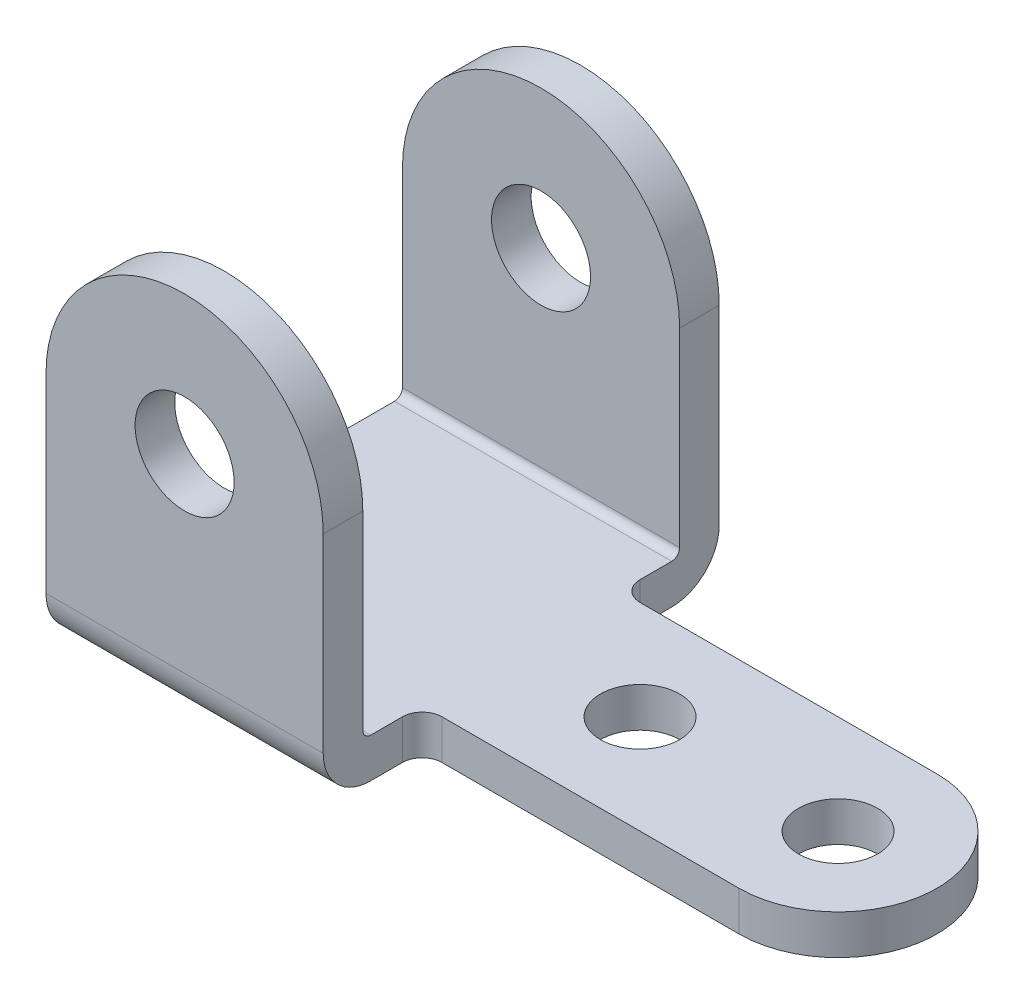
ISO-10303-21;
HEADER;
FILE_DESCRIPTION(('STEP AP214'),'2;1');
FILE_NAME('part.step','',(''),(''),'','','');
FILE_SCHEMA(('AUTOMOTIVE_DESIGN { 1 0 10303 214 1 1 1 1 }'));
ENDSEC;
DATA;
#1=APPLICATION_CONTEXT('core data for automotive mechanical design processes');
#2=APPLICATION_PROTOCOL_DEFINITION('international standard','automotive_design',2000,#1);
#3=PRODUCT_CONTEXT('',#1,'mechanical');
#4=PRODUCT('Part','Part','',(#3));
#5=PRODUCT_RELATED_PRODUCT_CATEGORY('part','',(#4));
#6=PRODUCT_DEFINITION_FORMATION('','',#4);
#7=PRODUCT_DEFINITION_CONTEXT('part definition',#1,'design');
#8=PRODUCT_DEFINITION('design','',#6,#7);
#9=PRODUCT_DEFINITION_SHAPE('','',#8);
#10=(LENGTH_UNIT() NAMED_UNIT(*) SI_UNIT(.MILLI.,.METRE.));
#11=(NAMED_UNIT(*) PLANE_ANGLE_UNIT() SI_UNIT($,.RADIAN.));
#12=(NAMED_UNIT(*) SI_UNIT($,.STERADIAN.) SOLID_ANGLE_UNIT());
#13=UNCERTAINTY_MEASURE_WITH_UNIT(LENGTH_MEASURE(1.E-05),#10,'distance_accuracy_value','');
#14=(GEOMETRIC_REPRESENTATION_CONTEXT(3) GLOBAL_UNCERTAINTY_ASSIGNED_CONTEXT((#13)) GLOBAL_UNIT_ASSIGNED_CONTEXT((#10,
#11,#12)) REPRESENTATION_CONTEXT('',''));
#15=CARTESIAN_POINT('',(0.,0.,0.));
#16=DIRECTION('',(0.,0.,1.));
#17=DIRECTION('',(1.,0.,0.));
#18=AXIS2_PLACEMENT_3D('',#15,#16,#17);
#19=CARTESIAN_POINT('',(35.,-60.,100.));
#20=DIRECTION('',(-1.,0.,0.));
#21=DIRECTION('',(0.,-1.,0.));
#22=AXIS2_PLACEMENT_3D('',#19,#20,#21);
#23=PLANE('',#22);
#24=DIRECTION('',(0.,0.,-1.));
#25=VECTOR('',#24,1.);
#26=CARTESIAN_POINT('',(35.,-60.,100.));
#27=LINE('',#26,#25);
#28=CARTESIAN_POINT('',(35.,-60.,88.));
#29=VERTEX_POINT('',#28);
#30=CARTESIAN_POINT('',(35.,-60.,80.));
#31=VERTEX_POINT('',#30);
#32=EDGE_CURVE('E264',#29,#31,#27,.T.);
#33=ORIENTED_EDGE('',*,*,#32,.T.);
#34=DIRECTION('',(0.,-1.,0.));
#35=VECTOR('',#34,1.);
#36=CARTESIAN_POINT('',(35.,-50.,80.));
#37=LINE('',#36,#35);
#38=CARTESIAN_POINT('',(35.,-50.,80.));
#39=VERTEX_POINT('',#38);
#40=EDGE_CURVE('E58',#31,#39,#37,.F.);
#41=ORIENTED_EDGE('',*,*,#40,.T.);
#42=DIRECTION('',(0.,0.,-1.));
#43=VECTOR('',#42,1.);
#44=CARTESIAN_POINT('',(35.,-50.,100.));
#45=LINE('',#44,#43);
#46=CARTESIAN_POINT('',(35.,-50.,88.));
#47=VERTEX_POINT('',#46);
#48=EDGE_CURVE('E217',#47,#39,#45,.T.);
#49=ORIENTED_EDGE('',*,*,#48,.F.);
#50=CARTESIAN_POINT('',(35.,-48.,88.));
#51=DIRECTION('',(-1.,0.,0.));
#52=DIRECTION('',(0.,-1.,0.));
#53=AXIS2_PLACEMENT_3D('',#50,#51,#52);
#54=CIRCLE('',#53,2.);
#55=CARTESIAN_POINT('',(35.,-48.,90.));
#56=VERTEX_POINT('',#55);
#57=EDGE_CURVE('E208',#56,#47,#54,.F.);
#58=ORIENTED_EDGE('',*,*,#57,.F.);
#59=DIRECTION('',(0.,1.,0.));
#60=VECTOR('',#59,1.);
#61=CARTESIAN_POINT('',(35.,-60.,90.));
#62=LINE('',#61,#60);
#63=CARTESIAN_POINT('',(35.,0.,90.));
#64=VERTEX_POINT('',#63);
#65=EDGE_CURVE('E238',#56,#64,#62,.T.);
#66=ORIENTED_EDGE('',*,*,#65,.T.);
#67=DIRECTION('',(0.,0.,-1.));
#68=VECTOR('',#67,1.);
#69=CARTESIAN_POINT('',(35.,0.,100.));
#70=LINE('',#69,#68);
#71=CARTESIAN_POINT('',(35.,0.,100.));
#72=VERTEX_POINT('',#71);
#73=EDGE_CURVE('E261',#72,#64,#70,.T.);
#74=ORIENTED_EDGE('',*,*,#73,.F.);
#75=DIRECTION('',(0.,1.,0.));
#76=VECTOR('',#75,1.);
#77=CARTESIAN_POINT('',(35.,-60.,100.));
#78=LINE('',#77,#76);
#79=CARTESIAN_POINT('',(35.,-48.,100.));
#80=VERTEX_POINT('',#79);
#81=EDGE_CURVE('E252',#80,#72,#78,.T.);
#82=ORIENTED_EDGE('',*,*,#81,.F.);
#83=CARTESIAN_POINT('',(35.,-48.,88.));
#84=DIRECTION('',(-1.,0.,0.));
#85=DIRECTION('',(0.,-1.,0.));
#86=AXIS2_PLACEMENT_3D('',#83,#84,#85);
#87=CIRCLE('',#86,12.);
#88=EDGE_CURVE('E278',#80,#29,#87,.F.);
#89=ORIENTED_EDGE('',*,*,#88,.T.);
#90=EDGE_LOOP('',(#33,#41,#49,#58,#66,#74,#82,#89));
#91=FACE_BOUND('',#90,.T.);
#92=ADVANCED_FACE('F39',(#91),#23,.F.);
#93=CARTESIAN_POINT('',(0.,0.,100.));
#94=DIRECTION('',(0.,0.,-1.));
#95=DIRECTION('',(-1.,0.,0.));
#96=AXIS2_PLACEMENT_3D('',#93,#94,#95);
#97=CYLINDRICAL_SURFACE('',#96,35.);
#98=CARTESIAN_POINT('',(0.,0.,9.99999999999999));
#99=DIRECTION('',(0.,0.,1.));
#100=DIRECTION('',(1.,0.,0.));
#101=AXIS2_PLACEMENT_3D('',#98,#99,#100);
#102=CIRCLE('',#101,35.);
#103=CARTESIAN_POINT('',(35.,0.,9.99999999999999));
#104=VERTEX_POINT('',#103);
#105=CARTESIAN_POINT('',(-35.,0.,9.99999999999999));
#106=VERTEX_POINT('',#105);
#107=EDGE_CURVE('E205',#104,#106,#102,.T.);
#108=ORIENTED_EDGE('',*,*,#107,.F.);
#109=CARTESIAN_POINT('',(35.,0.,0.));
#110=VERTEX_POINT('',#109);
#111=EDGE_CURVE('E254',#104,#110,#70,.T.);
#112=ORIENTED_EDGE('',*,*,#111,.T.);
#113=CARTESIAN_POINT('',(0.,0.,0.));
#114=DIRECTION('',(0.,0.,1.));
#115=DIRECTION('',(1.,0.,0.));
#116=AXIS2_PLACEMENT_3D('',#113,#114,#115);
#117=CIRCLE('',#116,35.);
#118=CARTESIAN_POINT('',(-35.,0.,0.));
#119=VERTEX_POINT('',#118);
#120=EDGE_CURVE('E220',#110,#119,#117,.T.);
#121=ORIENTED_EDGE('',*,*,#120,.T.);
#122=DIRECTION('',(0.,0.,-1.));
#123=VECTOR('',#122,1.);
#124=CARTESIAN_POINT('',(-35.,0.,100.));
#125=LINE('',#124,#123);
#126=EDGE_CURVE('E267',#106,#119,#125,.T.);
#127=ORIENTED_EDGE('',*,*,#126,.F.);
#128=EDGE_LOOP('',(#108,#112,#121,#127));
#129=FACE_BOUND('',#128,.T.);
#130=ADVANCED_FACE('F376',(#129),#97,.T.);
#131=ORIENTED_EDGE('',*,*,#73,.T.);
#132=CARTESIAN_POINT('',(0.,0.,90.));
#133=DIRECTION('',(0.,0.,1.));
#134=DIRECTION('',(1.,0.,0.));
#135=AXIS2_PLACEMENT_3D('',#132,#133,#134);
#136=CIRCLE('',#135,35.);
#137=CARTESIAN_POINT('',(-35.,0.,90.));
#138=VERTEX_POINT('',#137);
#139=EDGE_CURVE('E228',#64,#138,#136,.T.);
#140=ORIENTED_EDGE('',*,*,#139,.T.);
#141=CARTESIAN_POINT('',(-35.,0.,100.));
#142=VERTEX_POINT('',#141);
#143=EDGE_CURVE('E272',#142,#138,#125,.T.);
#144=ORIENTED_EDGE('',*,*,#143,.F.);
#145=CARTESIAN_POINT('',(0.,0.,100.));
#146=DIRECTION('',(0.,0.,1.));
#147=DIRECTION('',(1.,0.,0.));
#148=AXIS2_PLACEMENT_3D('',#145,#146,#147);
#149=CIRCLE('',#148,35.);
#150=EDGE_CURVE('E242',#72,#142,#149,.T.);
#151=ORIENTED_EDGE('',*,*,#150,.F.);
#152=EDGE_LOOP('',(#131,#140,#144,#151));
#153=FACE_BOUND('',#152,.T.);
#154=ADVANCED_FACE('F347',(#153),#97,.T.);
#155=CARTESIAN_POINT('',(-35.,0.,100.));
#156=DIRECTION('',(1.,0.,0.));
#157=DIRECTION('',(0.,1.,0.));
#158=AXIS2_PLACEMENT_3D('',#155,#156,#157);
#159=PLANE('',#158);
#160=ORIENTED_EDGE('',*,*,#143,.T.);
#161=DIRECTION('',(0.,-1.,0.));
#162=VECTOR('',#161,1.);
#163=CARTESIAN_POINT('',(-35.,0.,90.));
#164=LINE('',#163,#162);
#165=CARTESIAN_POINT('',(-35.,-48.,90.));
#166=VERTEX_POINT('',#165);
#167=EDGE_CURVE('E232',#138,#166,#164,.T.);
#168=ORIENTED_EDGE('',*,*,#167,.T.);
#169=CARTESIAN_POINT('',(-35.,-48.,88.));
#170=DIRECTION('',(1.,0.,0.));
#171=DIRECTION('',(0.,1.,0.));
#172=AXIS2_PLACEMENT_3D('',#169,#170,#171);
#173=CIRCLE('',#172,2.);
#174=CARTESIAN_POINT('',(-35.,-50.,88.));
#175=VERTEX_POINT('',#174);
#176=EDGE_CURVE('E216',#175,#166,#173,.F.);
#177=ORIENTED_EDGE('',*,*,#176,.F.);
#178=DIRECTION('',(0.,0.,-1.));
#179=VECTOR('',#178,1.);
#180=CARTESIAN_POINT('',(-35.,-50.,100.));
#181=LINE('',#180,#179);
#182=CARTESIAN_POINT('',(-35.,-50.,12.));
#183=VERTEX_POINT('',#182);
#184=EDGE_CURVE('E213',#175,#183,#181,.T.);
#185=ORIENTED_EDGE('',*,*,#184,.T.);
#186=CARTESIAN_POINT('',(-35.,-48.,12.));
#187=DIRECTION('',(1.,0.,0.));
#188=DIRECTION('',(0.,1.,0.));
#189=AXIS2_PLACEMENT_3D('',#186,#187,#188);
#190=CIRCLE('',#189,2.);
#191=CARTESIAN_POINT('',(-35.,-48.,10.));
#192=VERTEX_POINT('',#191);
#193=EDGE_CURVE('E207',#192,#183,#190,.F.);
#194=ORIENTED_EDGE('',*,*,#193,.F.);
#195=DIRECTION('',(0.,-1.,0.));
#196=VECTOR('',#195,1.);
#197=CARTESIAN_POINT('',(-35.,0.,9.99999999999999));
#198=LINE('',#197,#196);
#199=EDGE_CURVE('E227',#106,#192,#198,.T.);
#200=ORIENTED_EDGE('',*,*,#199,.F.);
#201=ORIENTED_EDGE('',*,*,#126,.T.);
#202=DIRECTION('',(0.,-1.,0.));
#203=VECTOR('',#202,1.);
#204=CARTESIAN_POINT('',(-35.,0.,0.));
#205=LINE('',#204,#203);
#206=CARTESIAN_POINT('',(-35.,-48.,0.));
#207=VERTEX_POINT('',#206);
#208=EDGE_CURVE('E256',#119,#207,#205,.T.);
#209=ORIENTED_EDGE('',*,*,#208,.T.);
#210=CARTESIAN_POINT('',(-35.,-48.,12.));
#211=DIRECTION('',(1.,0.,0.));
#212=DIRECTION('',(0.,1.,0.));
#213=AXIS2_PLACEMENT_3D('',#210,#211,#212);
#214=CIRCLE('',#213,12.);
#215=CARTESIAN_POINT('',(-35.,-60.,12.));
#216=VERTEX_POINT('',#215);
#217=EDGE_CURVE('E288',#207,#216,#214,.F.);
#218=ORIENTED_EDGE('',*,*,#217,.T.);
#219=DIRECTION('',(0.,0.,-1.));
#220=VECTOR('',#219,1.);
#221=CARTESIAN_POINT('',(-35.,-60.,100.));
#222=LINE('',#221,#220);
#223=CARTESIAN_POINT('',(-35.,-60.,88.));
#224=VERTEX_POINT('',#223);
#225=EDGE_CURVE('E266',#224,#216,#222,.T.);
#226=ORIENTED_EDGE('',*,*,#225,.F.);
#227=CARTESIAN_POINT('',(-35.,-48.,88.));
#228=DIRECTION('',(1.,0.,0.));
#229=DIRECTION('',(0.,1.,0.));
#230=AXIS2_PLACEMENT_3D('',#227,#228,#229);
#231=CIRCLE('',#230,12.);
#232=CARTESIAN_POINT('',(-35.,-48.,100.));
#233=VERTEX_POINT('',#232);
#234=EDGE_CURVE('E286',#224,#233,#231,.F.);
#235=ORIENTED_EDGE('',*,*,#234,.T.);
#236=DIRECTION('',(0.,-1.,0.));
#237=VECTOR('',#236,1.);
#238=CARTESIAN_POINT('',(-35.,0.,100.));
#239=LINE('',#238,#237);
#240=EDGE_CURVE('E250',#142,#233,#239,.T.);
#241=ORIENTED_EDGE('',*,*,#240,.F.);
#242=EDGE_LOOP('',(#160,#168,#177,#185,#194,#200,#201,#209,#218,#226,#235,#241));
#243=FACE_BOUND('',#242,.T.);
#244=ADVANCED_FACE('F355',(#243),#159,.F.);
#245=CARTESIAN_POINT('',(-35.,-60.,100.));
#246=DIRECTION('',(0.,1.,0.));
#247=DIRECTION('',(0.,0.,1.));
#248=AXIS2_PLACEMENT_3D('',#245,#246,#247);
#249=PLANE('',#248);
#250=CARTESIAN_POINT('',(115.,-60.,50.));
#251=DIRECTION('',(0.,-1.,0.));
#252=DIRECTION('',(1.,0.,0.));
#253=AXIS2_PLACEMENT_3D('',#250,#251,#252);
#254=CIRCLE('',#253,10.);
#255=CARTESIAN_POINT('',(125.,-60.,50.));
#256=VERTEX_POINT('',#255);
#257=EDGE_CURVE('E305',#256,#256,#254,.T.);
#258=ORIENTED_EDGE('',*,*,#257,.F.);
#259=EDGE_LOOP('',(#258));
#260=FACE_BOUND('',#259,.T.);
#261=CARTESIAN_POINT('',(65.,-60.,50.));
#262=DIRECTION('',(0.,-1.,0.));
#263=DIRECTION('',(1.,0.,0.));
#264=AXIS2_PLACEMENT_3D('',#261,#262,#263);
#265=CIRCLE('',#264,9.99999999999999);
#266=CARTESIAN_POINT('',(75.,-60.,50.));
#267=VERTEX_POINT('',#266);
#268=EDGE_CURVE('E296',#267,#267,#265,.T.);
#269=ORIENTED_EDGE('',*,*,#268,.F.);
#270=EDGE_LOOP('',(#269));
#271=FACE_BOUND('',#270,.T.);
#272=ORIENTED_EDGE('',*,*,#32,.F.);
#273=DIRECTION('',(1.,0.,0.));
#274=VECTOR('',#273,1.);
#275=CARTESIAN_POINT('',(-35.,-60.,88.));
#276=LINE('',#275,#274);
#277=EDGE_CURVE('E282',#29,#224,#276,.F.);
#278=ORIENTED_EDGE('',*,*,#277,.T.);
#279=ORIENTED_EDGE('',*,*,#225,.T.);
#280=DIRECTION('',(1.,0.,0.));
#281=VECTOR('',#280,1.);
#282=CARTESIAN_POINT('',(-35.,-60.,12.));
#283=LINE('',#282,#281);
#284=CARTESIAN_POINT('',(35.,-60.,12.));
#285=VERTEX_POINT('',#284);
#286=EDGE_CURVE('E283',#216,#285,#283,.T.);
#287=ORIENTED_EDGE('',*,*,#286,.T.);
#288=CARTESIAN_POINT('',(35.,-60.,20.));
#289=VERTEX_POINT('',#288);
#290=EDGE_CURVE('E262',#289,#285,#27,.T.);
#291=ORIENTED_EDGE('',*,*,#290,.F.);
#292=CARTESIAN_POINT('',(40.,-60.,20.));
#293=DIRECTION('',(0.,1.,0.));
#294=DIRECTION('',(0.,0.,1.));
#295=AXIS2_PLACEMENT_3D('',#292,#293,#294);
#296=CIRCLE('',#295,5.);
#297=CARTESIAN_POINT('',(40.,-60.,25.));
#298=VERTEX_POINT('',#297);
#299=EDGE_CURVE('E309',#289,#298,#296,.T.);
#300=ORIENTED_EDGE('',*,*,#299,.T.);
#301=DIRECTION('',(1.,0.,0.));
#302=VECTOR('',#301,1.);
#303=CARTESIAN_POINT('',(35.,-60.,25.));
#304=LINE('',#303,#302);
#305=CARTESIAN_POINT('',(115.,-60.,25.));
#306=VERTEX_POINT('',#305);
#307=EDGE_CURVE('E323',#298,#306,#304,.T.);
#308=ORIENTED_EDGE('',*,*,#307,.T.);
#309=CARTESIAN_POINT('',(115.,-60.,50.));
#310=DIRECTION('',(0.,-1.,0.));
#311=DIRECTION('',(0.,0.,-1.));
#312=AXIS2_PLACEMENT_3D('',#309,#310,#311);
#313=CIRCLE('',#312,25.);
#314=CARTESIAN_POINT('',(115.,-60.,75.));
#315=VERTEX_POINT('',#314);
#316=EDGE_CURVE('E174',#306,#315,#313,.T.);
#317=ORIENTED_EDGE('',*,*,#316,.T.);
#318=DIRECTION('',(1.,0.,0.));
#319=VECTOR('',#318,1.);
#320=CARTESIAN_POINT('',(35.,-60.,75.));
#321=LINE('',#320,#319);
#322=CARTESIAN_POINT('',(40.,-60.,75.));
#323=VERTEX_POINT('',#322);
#324=EDGE_CURVE('E197',#323,#315,#321,.T.);
#325=ORIENTED_EDGE('',*,*,#324,.F.);
#326=CARTESIAN_POINT('',(40.,-60.,80.));
#327=DIRECTION('',(0.,1.,0.));
#328=DIRECTION('',(0.,0.,1.));
#329=AXIS2_PLACEMENT_3D('',#326,#327,#328);
#330=CIRCLE('',#329,5.);
#331=EDGE_CURVE('E50',#323,#31,#330,.T.);
#332=ORIENTED_EDGE('',*,*,#331,.T.);
#333=EDGE_LOOP('',(#272,#278,#279,#287,#291,#300,#308,#317,#325,#332));
#334=FACE_BOUND('',#333,.T.);
#335=ADVANCED_FACE('F322',(#260,#271,#334),#249,.F.);
#336=CARTESIAN_POINT('',(35.,-50.,20.));
#337=VERTEX_POINT('',#336);
#338=CARTESIAN_POINT('',(35.,-50.,12.));
#339=VERTEX_POINT('',#338);
#340=EDGE_CURVE('E223',#337,#339,#45,.T.);
#341=ORIENTED_EDGE('',*,*,#340,.F.);
#342=DIRECTION('',(0.,-1.,0.));
#343=VECTOR('',#342,1.);
#344=CARTESIAN_POINT('',(35.,-60.,20.));
#345=LINE('',#344,#343);
#346=EDGE_CURVE('E292',#337,#289,#345,.T.);
#347=ORIENTED_EDGE('',*,*,#346,.T.);
#348=ORIENTED_EDGE('',*,*,#290,.T.);
#349=CARTESIAN_POINT('',(35.,-48.,12.));
#350=DIRECTION('',(-1.,0.,0.));
#351=DIRECTION('',(0.,-1.,0.));
#352=AXIS2_PLACEMENT_3D('',#349,#350,#351);
#353=CIRCLE('',#352,12.);
#354=CARTESIAN_POINT('',(35.,-48.,0.));
#355=VERTEX_POINT('',#354);
#356=EDGE_CURVE('E276',#285,#355,#353,.F.);
#357=ORIENTED_EDGE('',*,*,#356,.T.);
#358=DIRECTION('',(0.,1.,0.));
#359=VECTOR('',#358,1.);
#360=CARTESIAN_POINT('',(35.,-60.,0.));
#361=LINE('',#360,#359);
#362=EDGE_CURVE('E247',#355,#110,#361,.T.);
#363=ORIENTED_EDGE('',*,*,#362,.T.);
#364=ORIENTED_EDGE('',*,*,#111,.F.);
#365=DIRECTION('',(0.,1.,0.));
#366=VECTOR('',#365,1.);
#367=CARTESIAN_POINT('',(35.,-60.,9.99999999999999));
#368=LINE('',#367,#366);
#369=CARTESIAN_POINT('',(35.,-48.,10.));
#370=VERTEX_POINT('',#369);
#371=EDGE_CURVE('E222',#370,#104,#368,.T.);
#372=ORIENTED_EDGE('',*,*,#371,.F.);
#373=CARTESIAN_POINT('',(35.,-48.,12.));
#374=DIRECTION('',(-1.,0.,0.));
#375=DIRECTION('',(0.,-1.,0.));
#376=AXIS2_PLACEMENT_3D('',#373,#374,#375);
#377=CIRCLE('',#376,2.);
#378=EDGE_CURVE('E215',#339,#370,#377,.F.);
#379=ORIENTED_EDGE('',*,*,#378,.F.);
#380=EDGE_LOOP('',(#341,#347,#348,#357,#363,#364,#372,#379));
#381=FACE_BOUND('',#380,.T.);
#382=ADVANCED_FACE('F316',(#381),#23,.F.);
#383=CARTESIAN_POINT('',(0.,0.,100.));
#384=DIRECTION('',(0.,0.,1.));
#385=DIRECTION('',(1.,0.,0.));
#386=AXIS2_PLACEMENT_3D('',#383,#384,#385);
#387=PLANE('',#386);
#388=CARTESIAN_POINT('',(0.,0.,100.));
#389=DIRECTION('',(0.,0.,1.));
#390=DIRECTION('',(1.,0.,0.));
#391=AXIS2_PLACEMENT_3D('',#388,#389,#390);
#392=CIRCLE('',#391,12.5);
#393=CARTESIAN_POINT('',(12.5,0.,100.));
#394=VERTEX_POINT('',#393);
#395=EDGE_CURVE('E196',#394,#394,#392,.T.);
#396=ORIENTED_EDGE('',*,*,#395,.F.);
#397=EDGE_LOOP('',(#396));
#398=FACE_BOUND('',#397,.T.);
#399=ORIENTED_EDGE('',*,*,#240,.T.);
#400=DIRECTION('',(1.,0.,0.));
#401=VECTOR('',#400,1.);
#402=CARTESIAN_POINT('',(35.,-48.,100.));
#403=LINE('',#402,#401);
#404=EDGE_CURVE('E274',#233,#80,#403,.T.);
#405=ORIENTED_EDGE('',*,*,#404,.T.);
#406=ORIENTED_EDGE('',*,*,#81,.T.);
#407=ORIENTED_EDGE('',*,*,#150,.T.);
#408=EDGE_LOOP('',(#399,#405,#406,#407));
#409=FACE_BOUND('',#408,.T.);
#410=ADVANCED_FACE('F357',(#398,#409),#387,.T.);
#411=CARTESIAN_POINT('',(0.,0.,0.));
#412=DIRECTION('',(0.,0.,1.));
#413=DIRECTION('',(1.,0.,0.));
#414=AXIS2_PLACEMENT_3D('',#411,#412,#413);
#415=PLANE('',#414);
#416=CARTESIAN_POINT('',(0.,0.,0.));
#417=DIRECTION('',(0.,0.,1.));
#418=DIRECTION('',(1.,0.,0.));
#419=AXIS2_PLACEMENT_3D('',#416,#417,#418);
#420=CIRCLE('',#419,12.5);
#421=CARTESIAN_POINT('',(12.5,0.,0.));
#422=VERTEX_POINT('',#421);
#423=EDGE_CURVE('E195',#422,#422,#420,.T.);
#424=ORIENTED_EDGE('',*,*,#423,.T.);
#425=EDGE_LOOP('',(#424));
#426=FACE_BOUND('',#425,.T.);
#427=ORIENTED_EDGE('',*,*,#362,.F.);
#428=DIRECTION('',(1.,0.,0.));
#429=VECTOR('',#428,1.);
#430=CARTESIAN_POINT('',(0.,-48.,0.));
#431=LINE('',#430,#429);
#432=EDGE_CURVE('E289',#355,#207,#431,.F.);
#433=ORIENTED_EDGE('',*,*,#432,.T.);
#434=ORIENTED_EDGE('',*,*,#208,.F.);
#435=ORIENTED_EDGE('',*,*,#120,.F.);
#436=EDGE_LOOP('',(#427,#433,#434,#435));
#437=FACE_BOUND('',#436,.T.);
#438=ADVANCED_FACE('F364',(#426,#437),#415,.F.);
#439=CARTESIAN_POINT('',(0.,-48.,88.));
#440=DIRECTION('',(-1.,0.,0.));
#441=DIRECTION('',(0.,0.,1.));
#442=AXIS2_PLACEMENT_3D('',#439,#440,#441);
#443=CYLINDRICAL_SURFACE('',#442,12.);
#444=ORIENTED_EDGE('',*,*,#234,.F.);
#445=ORIENTED_EDGE('',*,*,#277,.F.);
#446=ORIENTED_EDGE('',*,*,#88,.F.);
#447=ORIENTED_EDGE('',*,*,#404,.F.);
#448=EDGE_LOOP('',(#444,#445,#446,#447));
#449=FACE_BOUND('',#448,.T.);
#450=ADVANCED_FACE('F363',(#449),#443,.T.);
#451=CARTESIAN_POINT('',(-35.,-48.,12.));
#452=DIRECTION('',(1.,0.,0.));
#453=DIRECTION('',(0.,0.,-1.));
#454=AXIS2_PLACEMENT_3D('',#451,#452,#453);
#455=CYLINDRICAL_SURFACE('',#454,12.);
#456=ORIENTED_EDGE('',*,*,#217,.F.);
#457=ORIENTED_EDGE('',*,*,#432,.F.);
#458=ORIENTED_EDGE('',*,*,#356,.F.);
#459=ORIENTED_EDGE('',*,*,#286,.F.);
#460=EDGE_LOOP('',(#456,#457,#458,#459));
#461=FACE_BOUND('',#460,.T.);
#462=ADVANCED_FACE('F361',(#461),#455,.T.);
#463=CARTESIAN_POINT('',(-35.,-50.,100.));
#464=DIRECTION('',(0.,1.,0.));
#465=DIRECTION('',(0.,0.,1.));
#466=AXIS2_PLACEMENT_3D('',#463,#464,#465);
#467=PLANE('',#466);
#468=CARTESIAN_POINT('',(115.,-50.,50.));
#469=DIRECTION('',(0.,1.,0.));
#470=DIRECTION('',(0.,0.,1.));
#471=AXIS2_PLACEMENT_3D('',#468,#469,#470);
#472=CIRCLE('',#471,10.);
#473=CARTESIAN_POINT('',(115.,-50.,60.));
#474=VERTEX_POINT('',#473);
#475=EDGE_CURVE('E299',#474,#474,#472,.T.);
#476=ORIENTED_EDGE('',*,*,#475,.F.);
#477=EDGE_LOOP('',(#476));
#478=FACE_BOUND('',#477,.T.);
#479=CARTESIAN_POINT('',(65.,-50.,50.));
#480=DIRECTION('',(0.,1.,0.));
#481=DIRECTION('',(0.,0.,1.));
#482=AXIS2_PLACEMENT_3D('',#479,#480,#481);
#483=CIRCLE('',#482,9.99999999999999);
#484=CARTESIAN_POINT('',(65.,-50.,60.));
#485=VERTEX_POINT('',#484);
#486=EDGE_CURVE('E294',#485,#485,#483,.T.);
#487=ORIENTED_EDGE('',*,*,#486,.F.);
#488=EDGE_LOOP('',(#487));
#489=FACE_BOUND('',#488,.T.);
#490=ORIENTED_EDGE('',*,*,#48,.T.);
#491=CARTESIAN_POINT('',(40.,-50.,80.));
#492=DIRECTION('',(0.,1.,0.));
#493=DIRECTION('',(0.,0.,1.));
#494=AXIS2_PLACEMENT_3D('',#491,#492,#493);
#495=CIRCLE('',#494,5.);
#496=CARTESIAN_POINT('',(40.,-50.,75.));
#497=VERTEX_POINT('',#496);
#498=EDGE_CURVE('E11',#39,#497,#495,.F.);
#499=ORIENTED_EDGE('',*,*,#498,.T.);
#500=DIRECTION('',(1.,0.,0.));
#501=VECTOR('',#500,1.);
#502=CARTESIAN_POINT('',(35.,-50.,75.));
#503=LINE('',#502,#501);
#504=CARTESIAN_POINT('',(115.,-50.,75.));
#505=VERTEX_POINT('',#504);
#506=EDGE_CURVE('E181',#497,#505,#503,.T.);
#507=ORIENTED_EDGE('',*,*,#506,.T.);
#508=CARTESIAN_POINT('',(115.,-50.,50.));
#509=DIRECTION('',(0.,1.,0.));
#510=DIRECTION('',(0.,0.,1.));
#511=AXIS2_PLACEMENT_3D('',#508,#509,#510);
#512=CIRCLE('',#511,25.);
#513=CARTESIAN_POINT('',(115.,-50.,25.));
#514=VERTEX_POINT('',#513);
#515=EDGE_CURVE('E178',#514,#505,#512,.F.);
#516=ORIENTED_EDGE('',*,*,#515,.F.);
#517=DIRECTION('',(1.,0.,0.));
#518=VECTOR('',#517,1.);
#519=CARTESIAN_POINT('',(35.,-50.,25.));
#520=LINE('',#519,#518);
#521=CARTESIAN_POINT('',(40.,-50.,25.));
#522=VERTEX_POINT('',#521);
#523=EDGE_CURVE('E165',#522,#514,#520,.T.);
#524=ORIENTED_EDGE('',*,*,#523,.F.);
#525=CARTESIAN_POINT('',(40.,-50.,20.));
#526=DIRECTION('',(0.,1.,0.));
#527=DIRECTION('',(0.,0.,1.));
#528=AXIS2_PLACEMENT_3D('',#525,#526,#527);
#529=CIRCLE('',#528,5.);
#530=EDGE_CURVE('E315',#522,#337,#529,.F.);
#531=ORIENTED_EDGE('',*,*,#530,.T.);
#532=ORIENTED_EDGE('',*,*,#340,.T.);
#533=DIRECTION('',(1.,0.,0.));
#534=VECTOR('',#533,1.);
#535=CARTESIAN_POINT('',(-35.,-50.,12.));
#536=LINE('',#535,#534);
#537=EDGE_CURVE('E210',#183,#339,#536,.T.);
#538=ORIENTED_EDGE('',*,*,#537,.F.);
#539=ORIENTED_EDGE('',*,*,#184,.F.);
#540=DIRECTION('',(1.,0.,0.));
#541=VECTOR('',#540,1.);
#542=CARTESIAN_POINT('',(-35.,-50.,88.));
#543=LINE('',#542,#541);
#544=EDGE_CURVE('E203',#47,#175,#543,.F.);
#545=ORIENTED_EDGE('',*,*,#544,.F.);
#546=EDGE_LOOP('',(#490,#499,#507,#516,#524,#531,#532,#538,#539,#545));
#547=FACE_BOUND('',#546,.T.);
#548=ADVANCED_FACE('F177',(#478,#489,#547),#467,.T.);
#549=CARTESIAN_POINT('',(0.,0.,90.));
#550=DIRECTION('',(0.,0.,1.));
#551=DIRECTION('',(1.,0.,0.));
#552=AXIS2_PLACEMENT_3D('',#549,#550,#551);
#553=PLANE('',#552);
#554=CARTESIAN_POINT('',(0.,0.,90.));
#555=DIRECTION('',(0.,0.,1.));
#556=DIRECTION('',(1.,0.,0.));
#557=AXIS2_PLACEMENT_3D('',#554,#555,#556);
#558=CIRCLE('',#557,12.5);
#559=CARTESIAN_POINT('',(12.5,0.,90.));
#560=VERTEX_POINT('',#559);
#561=EDGE_CURVE('E199',#560,#560,#558,.T.);
#562=ORIENTED_EDGE('',*,*,#561,.T.);
#563=EDGE_LOOP('',(#562));
#564=FACE_BOUND('',#563,.T.);
#565=ORIENTED_EDGE('',*,*,#167,.F.);
#566=ORIENTED_EDGE('',*,*,#139,.F.);
#567=ORIENTED_EDGE('',*,*,#65,.F.);
#568=DIRECTION('',(1.,0.,0.));
#569=VECTOR('',#568,1.);
#570=CARTESIAN_POINT('',(0.,-48.,90.));
#571=LINE('',#570,#569);
#572=EDGE_CURVE('E214',#166,#56,#571,.T.);
#573=ORIENTED_EDGE('',*,*,#572,.F.);
#574=EDGE_LOOP('',(#565,#566,#567,#573));
#575=FACE_BOUND('',#574,.T.);
#576=ADVANCED_FACE('F348',(#564,#575),#553,.F.);
#577=CARTESIAN_POINT('',(0.,0.,10.));
#578=DIRECTION('',(0.,0.,1.));
#579=DIRECTION('',(1.,0.,0.));
#580=AXIS2_PLACEMENT_3D('',#577,#578,#579);
#581=PLANE('',#580);
#582=CARTESIAN_POINT('',(0.,0.,10.));
#583=DIRECTION('',(0.,0.,1.));
#584=DIRECTION('',(1.,0.,0.));
#585=AXIS2_PLACEMENT_3D('',#582,#583,#584);
#586=CIRCLE('',#585,12.5);
#587=CARTESIAN_POINT('',(12.5,0.,10.));
#588=VERTEX_POINT('',#587);
#589=EDGE_CURVE('E194',#588,#588,#586,.T.);
#590=ORIENTED_EDGE('',*,*,#589,.F.);
#591=EDGE_LOOP('',(#590));
#592=FACE_BOUND('',#591,.T.);
#593=ORIENTED_EDGE('',*,*,#371,.T.);
#594=ORIENTED_EDGE('',*,*,#107,.T.);
#595=ORIENTED_EDGE('',*,*,#199,.T.);
#596=DIRECTION('',(1.,0.,0.));
#597=VECTOR('',#596,1.);
#598=CARTESIAN_POINT('',(0.,-48.,10.));
#599=LINE('',#598,#597);
#600=EDGE_CURVE('E212',#370,#192,#599,.F.);
#601=ORIENTED_EDGE('',*,*,#600,.F.);
#602=EDGE_LOOP('',(#593,#594,#595,#601));
#603=FACE_BOUND('',#602,.T.);
#604=ADVANCED_FACE('F418',(#592,#603),#581,.T.);
#605=CARTESIAN_POINT('',(0.,-48.,88.));
#606=DIRECTION('',(-1.,0.,0.));
#607=DIRECTION('',(0.,0.,1.));
#608=AXIS2_PLACEMENT_3D('',#605,#606,#607);
#609=CYLINDRICAL_SURFACE('',#608,2.);
#610=ORIENTED_EDGE('',*,*,#176,.T.);
#611=ORIENTED_EDGE('',*,*,#572,.T.);
#612=ORIENTED_EDGE('',*,*,#57,.T.);
#613=ORIENTED_EDGE('',*,*,#544,.T.);
#614=EDGE_LOOP('',(#610,#611,#612,#613));
#615=FACE_BOUND('',#614,.T.);
#616=ADVANCED_FACE('F341',(#615),#609,.F.);
#617=CARTESIAN_POINT('',(-35.,-48.,12.));
#618=DIRECTION('',(1.,0.,0.));
#619=DIRECTION('',(0.,0.,-1.));
#620=AXIS2_PLACEMENT_3D('',#617,#618,#619);
#621=CYLINDRICAL_SURFACE('',#620,2.);
#622=ORIENTED_EDGE('',*,*,#193,.T.);
#623=ORIENTED_EDGE('',*,*,#537,.T.);
#624=ORIENTED_EDGE('',*,*,#378,.T.);
#625=ORIENTED_EDGE('',*,*,#600,.T.);
#626=EDGE_LOOP('',(#622,#623,#624,#625));
#627=FACE_BOUND('',#626,.T.);
#628=ADVANCED_FACE('F414',(#627),#621,.F.);
#629=CARTESIAN_POINT('',(0.,0.,0.));
#630=DIRECTION('',(0.,0.,1.));
#631=DIRECTION('',(1.,0.,0.));
#632=AXIS2_PLACEMENT_3D('',#629,#630,#631);
#633=CYLINDRICAL_SURFACE('',#632,12.5);
#634=ORIENTED_EDGE('',*,*,#589,.T.);
#635=EDGE_LOOP('',(#634));
#636=FACE_BOUND('',#635,.T.);
#637=ORIENTED_EDGE('',*,*,#423,.F.);
#638=EDGE_LOOP('',(#637));
#639=FACE_BOUND('',#638,.T.);
#640=ADVANCED_FACE('F421',(#636,#639),#633,.F.);
#641=ORIENTED_EDGE('',*,*,#395,.T.);
#642=EDGE_LOOP('',(#641));
#643=FACE_BOUND('',#642,.T.);
#644=ORIENTED_EDGE('',*,*,#561,.F.);
#645=EDGE_LOOP('',(#644));
#646=FACE_BOUND('',#645,.T.);
#647=ADVANCED_FACE('F453',(#643,#646),#633,.F.);
#648=CARTESIAN_POINT('',(35.,66.2970334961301,25.));
#649=DIRECTION('',(0.,0.,-1.));
#650=DIRECTION('',(-1.,0.,0.));
#651=AXIS2_PLACEMENT_3D('',#648,#649,#650);
#652=PLANE('',#651);
#653=ORIENTED_EDGE('',*,*,#307,.F.);
#654=DIRECTION('',(0.,-1.,0.));
#655=VECTOR('',#654,1.);
#656=CARTESIAN_POINT('',(40.,66.2970334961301,25.));
#657=LINE('',#656,#655);
#658=EDGE_CURVE('E175',#298,#522,#657,.F.);
#659=ORIENTED_EDGE('',*,*,#658,.T.);
#660=ORIENTED_EDGE('',*,*,#523,.T.);
#661=DIRECTION('',(0.,-1.,0.));
#662=VECTOR('',#661,1.);
#663=CARTESIAN_POINT('',(115.,66.2970334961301,25.));
#664=LINE('',#663,#662);
#665=EDGE_CURVE('E169',#514,#306,#664,.T.);
#666=ORIENTED_EDGE('',*,*,#665,.T.);
#667=EDGE_LOOP('',(#653,#659,#660,#666));
#668=FACE_BOUND('',#667,.T.);
#669=ADVANCED_FACE('F170',(#668),#652,.T.);
#670=CARTESIAN_POINT('',(115.,66.2970334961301,50.));
#671=DIRECTION('',(0.,-1.,0.));
#672=DIRECTION('',(0.,0.,-1.));
#673=AXIS2_PLACEMENT_3D('',#670,#671,#672);
#674=CYLINDRICAL_SURFACE('',#673,25.);
#675=ORIENTED_EDGE('',*,*,#665,.F.);
#676=ORIENTED_EDGE('',*,*,#515,.T.);
#677=DIRECTION('',(0.,-1.,0.));
#678=VECTOR('',#677,1.);
#679=CARTESIAN_POINT('',(115.,66.2970334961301,75.));
#680=LINE('',#679,#678);
#681=EDGE_CURVE('E184',#505,#315,#680,.T.);
#682=ORIENTED_EDGE('',*,*,#681,.T.);
#683=ORIENTED_EDGE('',*,*,#316,.F.);
#684=EDGE_LOOP('',(#675,#676,#682,#683));
#685=FACE_BOUND('',#684,.T.);
#686=ADVANCED_FACE('F190',(#685),#674,.T.);
#687=CARTESIAN_POINT('',(35.,66.2970334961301,75.));
#688=DIRECTION('',(0.,0.,-1.));
#689=DIRECTION('',(-1.,0.,0.));
#690=AXIS2_PLACEMENT_3D('',#687,#688,#689);
#691=PLANE('',#690);
#692=ORIENTED_EDGE('',*,*,#506,.F.);
#693=DIRECTION('',(0.,-1.,0.));
#694=VECTOR('',#693,1.);
#695=CARTESIAN_POINT('',(40.,-60.,75.));
#696=LINE('',#695,#694);
#697=EDGE_CURVE('E306',#497,#323,#696,.T.);
#698=ORIENTED_EDGE('',*,*,#697,.T.);
#699=ORIENTED_EDGE('',*,*,#324,.T.);
#700=ORIENTED_EDGE('',*,*,#681,.F.);
#701=EDGE_LOOP('',(#692,#698,#699,#700));
#702=FACE_BOUND('',#701,.T.);
#703=ADVANCED_FACE('F331',(#702),#691,.F.);
#704=CARTESIAN_POINT('',(65.,35.,50.));
#705=DIRECTION('',(0.,-1.,0.));
#706=DIRECTION('',(1.,0.,0.));
#707=AXIS2_PLACEMENT_3D('',#704,#705,#706);
#708=CYLINDRICAL_SURFACE('',#707,9.99999999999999);
#709=ORIENTED_EDGE('',*,*,#486,.T.);
#710=EDGE_LOOP('',(#709));
#711=FACE_BOUND('',#710,.T.);
#712=ORIENTED_EDGE('',*,*,#268,.T.);
#713=EDGE_LOOP('',(#712));
#714=FACE_BOUND('',#713,.T.);
#715=ADVANCED_FACE('F475',(#711,#714),#708,.F.);
#716=CARTESIAN_POINT('',(115.,35.,50.));
#717=DIRECTION('',(0.,-1.,0.));
#718=DIRECTION('',(1.,0.,0.));
#719=AXIS2_PLACEMENT_3D('',#716,#717,#718);
#720=CYLINDRICAL_SURFACE('',#719,10.);
#721=ORIENTED_EDGE('',*,*,#475,.T.);
#722=EDGE_LOOP('',(#721));
#723=FACE_BOUND('',#722,.T.);
#724=ORIENTED_EDGE('',*,*,#257,.T.);
#725=EDGE_LOOP('',(#724));
#726=FACE_BOUND('',#725,.T.);
#727=ADVANCED_FACE('F478',(#723,#726),#720,.F.);
#728=CARTESIAN_POINT('',(40.,-60.,20.));
#729=DIRECTION('',(0.,-1.,0.));
#730=DIRECTION('',(1.,0.,0.));
#731=AXIS2_PLACEMENT_3D('',#728,#729,#730);
#732=CYLINDRICAL_SURFACE('',#731,5.);
#733=ORIENTED_EDGE('',*,*,#530,.F.);
#734=ORIENTED_EDGE('',*,*,#658,.F.);
#735=ORIENTED_EDGE('',*,*,#299,.F.);
#736=ORIENTED_EDGE('',*,*,#346,.F.);
#737=EDGE_LOOP('',(#733,#734,#735,#736));
#738=FACE_BOUND('',#737,.T.);
#739=ADVANCED_FACE('F325',(#738),#732,.F.);
#740=CARTESIAN_POINT('',(40.,66.2970334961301,80.));
#741=DIRECTION('',(0.,1.,0.));
#742=DIRECTION('',(-1.,0.,0.));
#743=AXIS2_PLACEMENT_3D('',#740,#741,#742);
#744=CYLINDRICAL_SURFACE('',#743,5.);
#745=ORIENTED_EDGE('',*,*,#498,.F.);
#746=ORIENTED_EDGE('',*,*,#40,.F.);
#747=ORIENTED_EDGE('',*,*,#331,.F.);
#748=ORIENTED_EDGE('',*,*,#697,.F.);
#749=EDGE_LOOP('',(#745,#746,#747,#748));
#750=FACE_BOUND('',#749,.T.);
#751=ADVANCED_FACE('F41',(#750),#744,.F.);
#752=CLOSED_SHELL('',(#92,#130,#154,#244,#335,#382,#410,#438,#450,#462,#548,#576,#604,#616,#628,
#640,#647,#669,#686,#703,#715,#727,#739,#751));
#753=MANIFOLD_SOLID_BREP('B2',#752);
#754=ADVANCED_BREP_SHAPE_REPRESENTATION('',(#18,#753),#14);
#755=SHAPE_DEFINITION_REPRESENTATION(#9,#754);
ENDSEC;
END-ISO-10303-21;
